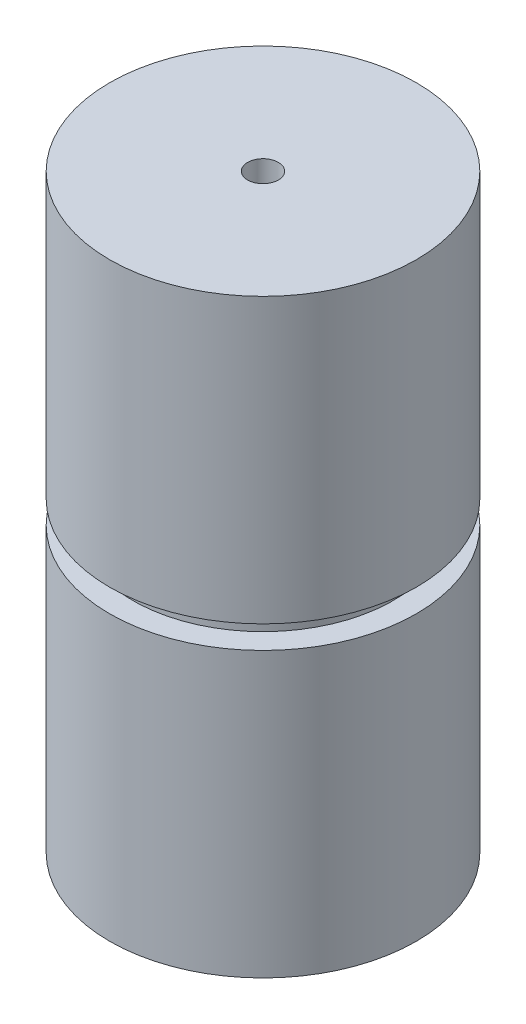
ISO-10303-21;
HEADER;
FILE_DESCRIPTION(('STEP AP214'),'2;1');
FILE_NAME('part.step','',(''),(''),'','','');
FILE_SCHEMA(('AUTOMOTIVE_DESIGN { 1 0 10303 214 1 1 1 1 }'));
ENDSEC;
DATA;
#1=APPLICATION_CONTEXT('core data for automotive mechanical design processes');
#2=APPLICATION_PROTOCOL_DEFINITION('international standard','automotive_design',2000,#1);
#3=PRODUCT_CONTEXT('',#1,'mechanical');
#4=PRODUCT('Part','Part','',(#3));
#5=PRODUCT_RELATED_PRODUCT_CATEGORY('part','',(#4));
#6=PRODUCT_DEFINITION_FORMATION('','',#4);
#7=PRODUCT_DEFINITION_CONTEXT('part definition',#1,'design');
#8=PRODUCT_DEFINITION('design','',#6,#7);
#9=PRODUCT_DEFINITION_SHAPE('','',#8);
#10=(LENGTH_UNIT() NAMED_UNIT(*) SI_UNIT(.MILLI.,.METRE.));
#11=(NAMED_UNIT(*) PLANE_ANGLE_UNIT() SI_UNIT($,.RADIAN.));
#12=(NAMED_UNIT(*) SI_UNIT($,.STERADIAN.) SOLID_ANGLE_UNIT());
#13=UNCERTAINTY_MEASURE_WITH_UNIT(LENGTH_MEASURE(1.E-05),#10,'distance_accuracy_value','');
#14=(GEOMETRIC_REPRESENTATION_CONTEXT(3) GLOBAL_UNCERTAINTY_ASSIGNED_CONTEXT((#13)) GLOBAL_UNIT_ASSIGNED_CONTEXT((#10,
#11,#12)) REPRESENTATION_CONTEXT('',''));
#15=CARTESIAN_POINT('',(0.,0.,0.));
#16=DIRECTION('',(0.,0.,1.));
#17=DIRECTION('',(1.,0.,0.));
#18=AXIS2_PLACEMENT_3D('',#15,#16,#17);
#19=CARTESIAN_POINT('',(0.,3.,0.));
#20=DIRECTION('',(0.,-1.,0.));
#21=DIRECTION('',(0.,0.,-1.));
#22=AXIS2_PLACEMENT_3D('',#19,#20,#21);
#23=CYLINDRICAL_SURFACE('',#22,17.);
#24=CARTESIAN_POINT('',(0.,3.,0.));
#25=DIRECTION('',(0.,1.,0.));
#26=DIRECTION('',(0.,0.,1.));
#27=AXIS2_PLACEMENT_3D('',#24,#25,#26);
#28=CIRCLE('',#27,17.);
#29=CARTESIAN_POINT('',(0.,3.,17.));
#30=VERTEX_POINT('',#29);
#31=EDGE_CURVE('E10',#30,#30,#28,.T.);
#32=ORIENTED_EDGE('',*,*,#31,.F.);
#33=EDGE_LOOP('',(#32));
#34=FACE_BOUND('',#33,.T.);
#35=CARTESIAN_POINT('',(0.,0.,0.));
#36=DIRECTION('',(0.,-1.,0.));
#37=DIRECTION('',(0.,0.,-1.));
#38=AXIS2_PLACEMENT_3D('',#35,#36,#37);
#39=CIRCLE('',#38,17.);
#40=CARTESIAN_POINT('',(0.,0.,-17.));
#41=VERTEX_POINT('',#40);
#42=EDGE_CURVE('E44',#41,#41,#39,.T.);
#43=ORIENTED_EDGE('',*,*,#42,.F.);
#44=EDGE_LOOP('',(#43));
#45=FACE_BOUND('',#44,.T.);
#46=ADVANCED_FACE('F30',(#34,#45),#23,.T.);
#47=CARTESIAN_POINT('',(0.,3.,0.));
#48=DIRECTION('',(0.,1.,0.));
#49=DIRECTION('',(0.,0.,1.));
#50=AXIS2_PLACEMENT_3D('',#47,#48,#49);
#51=PLANE('',#50);
#52=CARTESIAN_POINT('',(0.,3.,0.));
#53=DIRECTION('',(0.,1.,0.));
#54=DIRECTION('',(0.,0.,1.));
#55=AXIS2_PLACEMENT_3D('',#52,#53,#54);
#56=CIRCLE('',#55,20.);
#57=CARTESIAN_POINT('',(0.,3.,20.));
#58=VERTEX_POINT('',#57);
#59=EDGE_CURVE('E40',#58,#58,#56,.T.);
#60=ORIENTED_EDGE('',*,*,#59,.F.);
#61=EDGE_LOOP('',(#60));
#62=FACE_BOUND('',#61,.T.);
#63=ORIENTED_EDGE('',*,*,#31,.T.);
#64=EDGE_LOOP('',(#63));
#65=FACE_BOUND('',#64,.T.);
#66=ADVANCED_FACE('F91',(#62,#65),#51,.F.);
#67=CARTESIAN_POINT('',(0.,40.,0.));
#68=DIRECTION('',(0.,-1.,0.));
#69=DIRECTION('',(0.,0.,-1.));
#70=AXIS2_PLACEMENT_3D('',#67,#68,#69);
#71=CYLINDRICAL_SURFACE('',#70,20.);
#72=CARTESIAN_POINT('',(0.,40.,0.));
#73=DIRECTION('',(0.,1.,0.));
#74=DIRECTION('',(0.,0.,1.));
#75=AXIS2_PLACEMENT_3D('',#72,#73,#74);
#76=CIRCLE('',#75,20.);
#77=CARTESIAN_POINT('',(0.,40.,20.));
#78=VERTEX_POINT('',#77);
#79=EDGE_CURVE('E36',#78,#78,#76,.T.);
#80=ORIENTED_EDGE('',*,*,#79,.F.);
#81=EDGE_LOOP('',(#80));
#82=FACE_BOUND('',#81,.T.);
#83=ORIENTED_EDGE('',*,*,#59,.T.);
#84=EDGE_LOOP('',(#83));
#85=FACE_BOUND('',#84,.T.);
#86=ADVANCED_FACE('F96',(#82,#85),#71,.T.);
#87=CARTESIAN_POINT('',(0.,40.,0.));
#88=DIRECTION('',(0.,1.,0.));
#89=DIRECTION('',(0.,0.,1.));
#90=AXIS2_PLACEMENT_3D('',#87,#88,#89);
#91=PLANE('',#90);
#92=CARTESIAN_POINT('',(0.,40.,0.));
#93=DIRECTION('',(0.,1.,0.));
#94=DIRECTION('',(0.,0.,1.));
#95=AXIS2_PLACEMENT_3D('',#92,#93,#94);
#96=CIRCLE('',#95,2.);
#97=CARTESIAN_POINT('',(0.,40.,2.));
#98=VERTEX_POINT('',#97);
#99=EDGE_CURVE('E58',#98,#98,#96,.T.);
#100=ORIENTED_EDGE('',*,*,#99,.F.);
#101=EDGE_LOOP('',(#100));
#102=FACE_BOUND('',#101,.T.);
#103=ORIENTED_EDGE('',*,*,#79,.T.);
#104=EDGE_LOOP('',(#103));
#105=FACE_BOUND('',#104,.T.);
#106=ADVANCED_FACE('F86',(#102,#105),#91,.T.);
#107=CARTESIAN_POINT('',(0.,0.,0.));
#108=DIRECTION('',(0.,-1.,0.));
#109=DIRECTION('',(0.,0.,-1.));
#110=AXIS2_PLACEMENT_3D('',#107,#108,#109);
#111=PLANE('',#110);
#112=CARTESIAN_POINT('',(0.,0.,0.));
#113=DIRECTION('',(0.,-1.,0.));
#114=DIRECTION('',(0.,0.,-1.));
#115=AXIS2_PLACEMENT_3D('',#112,#113,#114);
#116=CIRCLE('',#115,20.);
#117=CARTESIAN_POINT('',(0.,0.,-20.));
#118=VERTEX_POINT('',#117);
#119=EDGE_CURVE('E52',#118,#118,#116,.T.);
#120=ORIENTED_EDGE('',*,*,#119,.F.);
#121=EDGE_LOOP('',(#120));
#122=FACE_BOUND('',#121,.T.);
#123=ORIENTED_EDGE('',*,*,#42,.T.);
#124=EDGE_LOOP('',(#123));
#125=FACE_BOUND('',#124,.T.);
#126=ADVANCED_FACE('F80',(#122,#125),#111,.F.);
#127=CARTESIAN_POINT('',(0.,-37.,0.));
#128=DIRECTION('',(0.,1.,0.));
#129=DIRECTION('',(0.,0.,1.));
#130=AXIS2_PLACEMENT_3D('',#127,#128,#129);
#131=CYLINDRICAL_SURFACE('',#130,20.);
#132=CARTESIAN_POINT('',(0.,-37.,0.));
#133=DIRECTION('',(0.,-1.,0.));
#134=DIRECTION('',(0.,0.,-1.));
#135=AXIS2_PLACEMENT_3D('',#132,#133,#134);
#136=CIRCLE('',#135,20.);
#137=CARTESIAN_POINT('',(0.,-37.,-20.));
#138=VERTEX_POINT('',#137);
#139=EDGE_CURVE('E49',#138,#138,#136,.T.);
#140=ORIENTED_EDGE('',*,*,#139,.F.);
#141=EDGE_LOOP('',(#140));
#142=FACE_BOUND('',#141,.T.);
#143=ORIENTED_EDGE('',*,*,#119,.T.);
#144=EDGE_LOOP('',(#143));
#145=FACE_BOUND('',#144,.T.);
#146=ADVANCED_FACE('F74',(#142,#145),#131,.T.);
#147=CARTESIAN_POINT('',(0.,-37.,0.));
#148=DIRECTION('',(0.,-1.,0.));
#149=DIRECTION('',(0.,0.,-1.));
#150=AXIS2_PLACEMENT_3D('',#147,#148,#149);
#151=PLANE('',#150);
#152=CARTESIAN_POINT('',(0.,-37.,0.));
#153=DIRECTION('',(0.,-1.,0.));
#154=DIRECTION('',(0.,0.,-1.));
#155=AXIS2_PLACEMENT_3D('',#152,#153,#154);
#156=CIRCLE('',#155,2.);
#157=CARTESIAN_POINT('',(0.,-37.,-2.));
#158=VERTEX_POINT('',#157);
#159=EDGE_CURVE('E64',#158,#158,#156,.T.);
#160=ORIENTED_EDGE('',*,*,#159,.F.);
#161=EDGE_LOOP('',(#160));
#162=FACE_BOUND('',#161,.T.);
#163=ORIENTED_EDGE('',*,*,#139,.T.);
#164=EDGE_LOOP('',(#163));
#165=FACE_BOUND('',#164,.T.);
#166=ADVANCED_FACE('F70',(#162,#165),#151,.T.);
#167=CARTESIAN_POINT('',(0.,24.,0.));
#168=DIRECTION('',(0.,1.,0.));
#169=DIRECTION('',(0.,0.,1.));
#170=AXIS2_PLACEMENT_3D('',#167,#168,#169);
#171=CYLINDRICAL_SURFACE('',#170,2.);
#172=CARTESIAN_POINT('',(0.,24.,0.));
#173=DIRECTION('',(0.,1.,0.));
#174=DIRECTION('',(0.,0.,1.));
#175=AXIS2_PLACEMENT_3D('',#172,#173,#174);
#176=CIRCLE('',#175,2.);
#177=CARTESIAN_POINT('',(0.,24.,2.));
#178=VERTEX_POINT('',#177);
#179=EDGE_CURVE('E55',#178,#178,#176,.T.);
#180=ORIENTED_EDGE('',*,*,#179,.F.);
#181=EDGE_LOOP('',(#180));
#182=FACE_BOUND('',#181,.T.);
#183=ORIENTED_EDGE('',*,*,#99,.T.);
#184=EDGE_LOOP('',(#183));
#185=FACE_BOUND('',#184,.T.);
#186=ADVANCED_FACE('F73',(#182,#185),#171,.F.);
#187=CARTESIAN_POINT('',(0.,24.,0.));
#188=DIRECTION('',(0.,1.,0.));
#189=DIRECTION('',(0.,0.,1.));
#190=AXIS2_PLACEMENT_3D('',#187,#188,#189);
#191=PLANE('',#190);
#192=ORIENTED_EDGE('',*,*,#179,.T.);
#193=EDGE_LOOP('',(#192));
#194=FACE_BOUND('',#193,.T.);
#195=ADVANCED_FACE('F112',(#194),#191,.T.);
#196=CARTESIAN_POINT('',(0.,-21.,0.));
#197=DIRECTION('',(0.,-1.,0.));
#198=DIRECTION('',(0.,0.,-1.));
#199=AXIS2_PLACEMENT_3D('',#196,#197,#198);
#200=CYLINDRICAL_SURFACE('',#199,2.);
#201=CARTESIAN_POINT('',(0.,-21.,0.));
#202=DIRECTION('',(0.,-1.,0.));
#203=DIRECTION('',(0.,0.,-1.));
#204=AXIS2_PLACEMENT_3D('',#201,#202,#203);
#205=CIRCLE('',#204,2.);
#206=CARTESIAN_POINT('',(0.,-21.,-2.));
#207=VERTEX_POINT('',#206);
#208=EDGE_CURVE('E61',#207,#207,#205,.T.);
#209=ORIENTED_EDGE('',*,*,#208,.F.);
#210=EDGE_LOOP('',(#209));
#211=FACE_BOUND('',#210,.T.);
#212=ORIENTED_EDGE('',*,*,#159,.T.);
#213=EDGE_LOOP('',(#212));
#214=FACE_BOUND('',#213,.T.);
#215=ADVANCED_FACE('F68',(#211,#214),#200,.F.);
#216=CARTESIAN_POINT('',(0.,-21.,0.));
#217=DIRECTION('',(0.,-1.,0.));
#218=DIRECTION('',(0.,0.,-1.));
#219=AXIS2_PLACEMENT_3D('',#216,#217,#218);
#220=PLANE('',#219);
#221=ORIENTED_EDGE('',*,*,#208,.T.);
#222=EDGE_LOOP('',(#221));
#223=FACE_BOUND('',#222,.T.);
#224=ADVANCED_FACE('F124',(#223),#220,.T.);
#225=CLOSED_SHELL('',(#46,#66,#86,#106,#126,#146,#166,#186,#195,#215,#224));
#226=MANIFOLD_SOLID_BREP('B2',#225);
#227=ADVANCED_BREP_SHAPE_REPRESENTATION('',(#18,#226),#14);
#228=SHAPE_DEFINITION_REPRESENTATION(#9,#227);
ENDSEC;
END-ISO-10303-21;
